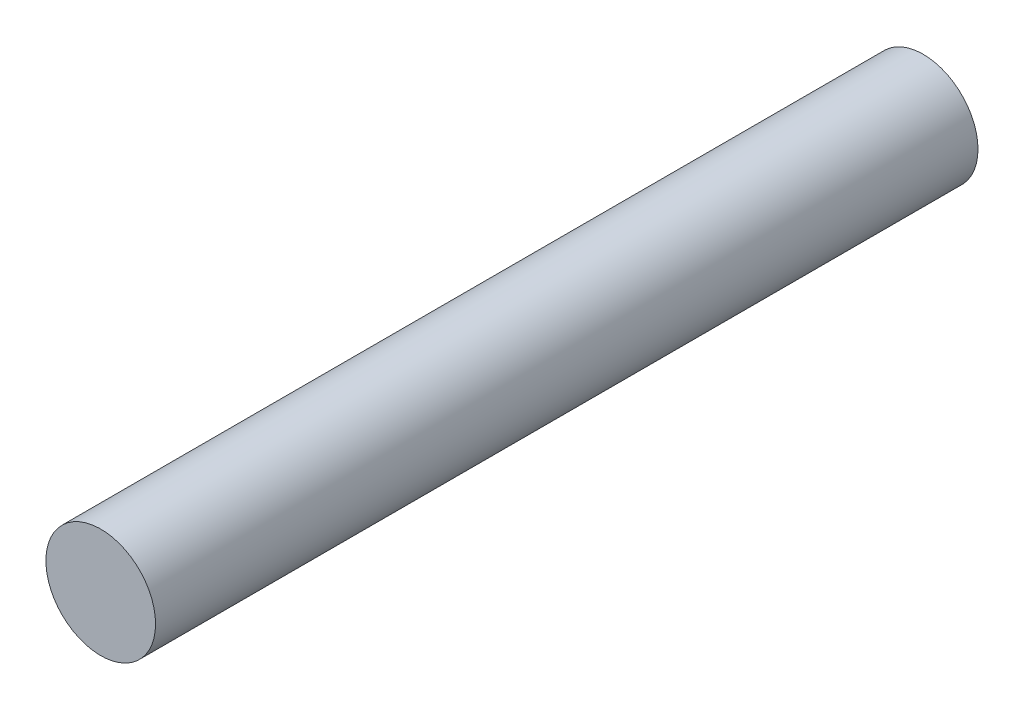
from build123d import *

# Parameters (mm, degrees)
SKETCH1_R           = 30
BOSS_EXTRUDE1_DEPTH = 450


with BuildPart() as part:
    # Sketch1 → Boss-Extrude1 (new body)
    with BuildSketch(Plane.XY):
        Circle(SKETCH1_R)
    extrude(amount=-BOSS_EXTRUDE1_DEPTH)


solid = part.part
